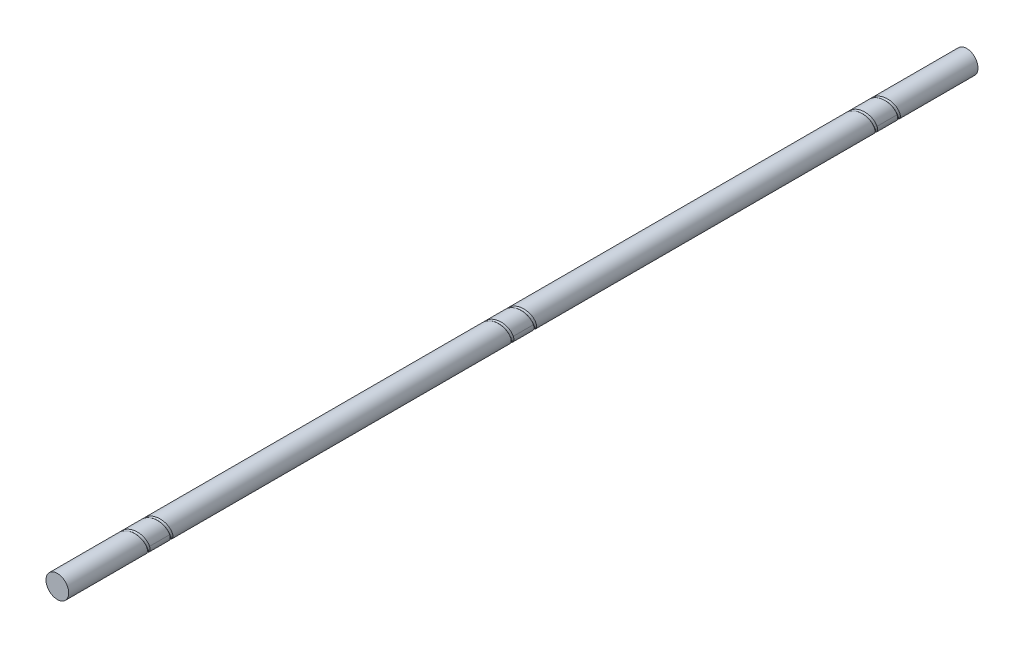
from build123d import *

# Parameters (mm, degrees)
SKETCH1_R              = 25
BOSS_EXTRUDE1_DEPTH    = 2000
CUT_SWEEP1_PITCH       = 50
CUT_SWEEP1_HEIGHT      = 100
CUT_SWEEP1_RADIUS      = 27.646
CUT_SWEEP1_START_ANGLE = -180
SKETCH3_R              = 3.969
LPATTERN1_COUNT        = 3
LPATTERN1_PITCH        = 800


with BuildPart() as part:
    # Sketch1 → Boss-Extrude1 (new body)
    with BuildSketch(Plane.XY):
        Circle(SKETCH1_R)
    extrude(amount=BOSS_EXTRUDE1_DEPTH)

    # Cut-Sweep1: sweep along a helix
    with BuildLine() as cut_sweep1_path:
        add(Helix(CUT_SWEEP1_PITCH, CUT_SWEEP1_HEIGHT, CUT_SWEEP1_RADIUS, center=(0, 0, 150), direction=(0, 0, 1), mode=Mode.PRIVATE).rotate(Axis((0, 0, 150), (0, 0, 1)), CUT_SWEEP1_START_ANGLE))
    # Sketch3 → Cut-Sweep1 (sweep, cut)
    with BuildSketch(Plane(origin=(0, 0, 0), x_dir=(1, 0, 0), z_dir=(0, 1, 0))):
        with Locations((-27.646, -150)):
            Circle(SKETCH3_R)
    cut_sweep1 = sweep(path=cut_sweep1_path.line, is_frenet=True, mode=Mode.SUBTRACT)

    # LPattern1: Cut-Sweep1 ×3
    with Locations(*[(0, 0, i * LPATTERN1_PITCH) for i in range(1, LPATTERN1_COUNT)]):
        add(cut_sweep1, mode=Mode.SUBTRACT)


solid = part.part
